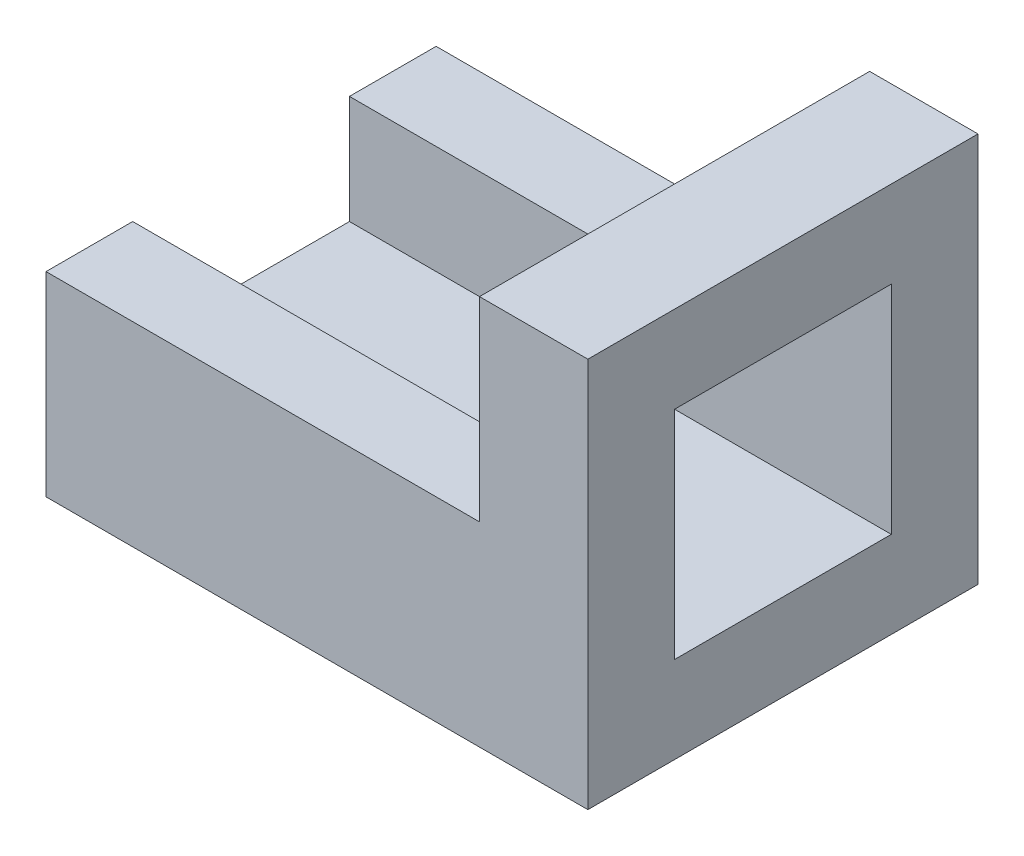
from build123d import *

# Parameters (mm, degrees)
EXTRUDE_1_DEPTH     = 36
SKETCH_2_W          = 40
SKETCH_2_H          = 40
CUT_EXTRUDE_1_DEPTH = 129.374452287


with BuildPart() as part:
    # Sketch 1 → Extrude 1 (new, symmetric)
    with BuildSketch(Plane.XY):
        Polygon((80, 72), (80, 36), (0, 36), (0, 0), (100, 0), (100, 72), align=None)
    extrude(amount=EXTRUDE_1_DEPTH, both=True)

    # Sketch 2 → Cut-Extrude 1 (cut, through all)
    with BuildSketch(Plane(origin=(100, 0, 0), x_dir=(0, 0, -1), z_dir=(1, 0, 0))):
        with Locations((0, 36)):
            Rectangle(SKETCH_2_W, SKETCH_2_H)
    extrude(amount=-CUT_EXTRUDE_1_DEPTH, mode=Mode.SUBTRACT)


solid = part.part
